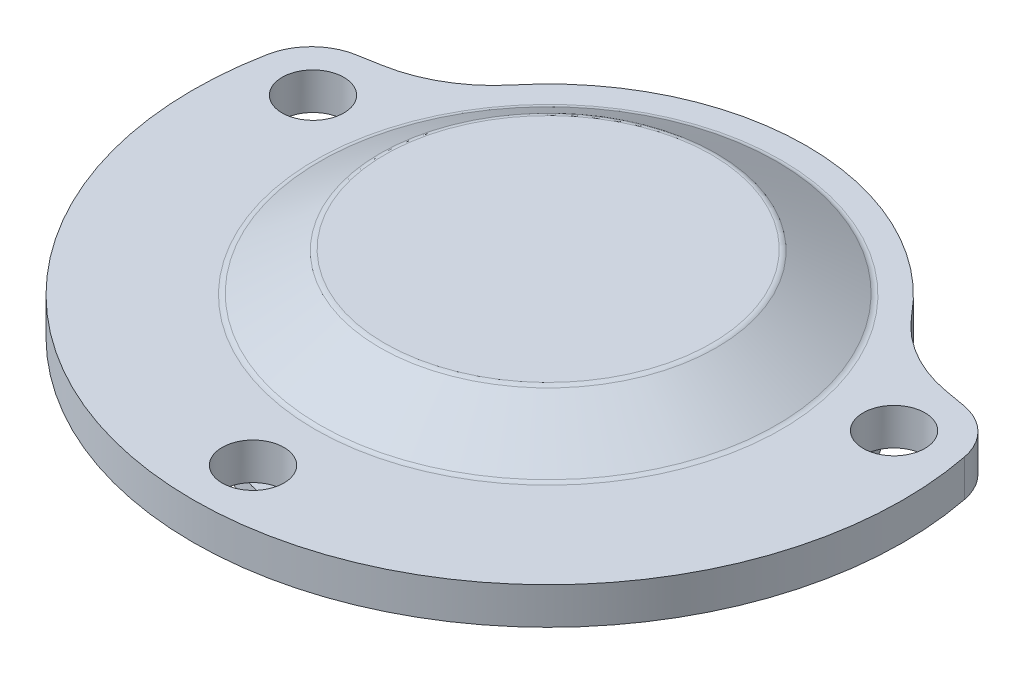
from build123d import *

# Parameters (mm, degrees)
FORO_6_7_6_7_1_D         = 6.7
TAGLIO_ESTRUSIONE2_DEPTH = 10
RACCORDO1_R              = 6
RACCORDO2_R              = 15
RACCORDO3_R              = 1
RACCORDO4_R              = 1


with BuildPart() as part:
    # Schizzo1 → Rivoluzione1 (revolve)
    with BuildSketch(Plane.XY, mode=Mode.PRIVATE) as rivoluzione1_sk:
        Polygon((0, 5), (0, 9.8), (18, 9.8), (25, 5.5), (38.5, 5.5), (38.5, 1.5), (26, 1.5), (26, -0.2), (23.9, -0.2), (23.9, -3.5), (26, -3.5), (26, -5.5), (19, -5.5), (19, 5), align=None)
    revolve(rivoluzione1_sk.sketch.rotate(Axis((0, 0, 0), (0, 1, 0)), 90), axis=Axis((0, 0, 0), (0, 1, 0)))

    # Foro _6.7 _6.7_-1 (through all)
    with Locations(Plane(origin=(0, 5.5, 0), x_dir=(1, 0, 0), z_dir=(0, 1, 0))):
        with Locations((0, -32), (-31.5, 6), (31.5, 6)):
            Hole(FORO_6_7_6_7_1_D / 2)

    # Schizzo5 → Taglio-Estrusione2 (cut)
    with BuildSketch(Plane(origin=(0, 0, 0), x_dir=(1, 0, 0), z_dir=(0, 1, 0))):
        with BuildLine():
            Line((-45, 10), (-24.463539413, 13.62113209))
            ThreePointArc((-24.463539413, 13.62113209), (0, 28), (24.463539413, 13.62113209))
            Line((24.463539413, 13.62113209), (45, 10))
            Line((45, 10), (45, 45))
            Line((45, 45), (-45, 45))
            Line((-45, 45), (-45, 10))
        make_face()
    extrude(amount=TAGLIO_ESTRUSIONE2_DEPTH, mode=Mode.SUBTRACT)

    # Raccordo1
    raccordo1_edges = [part.edges().sort_by_distance(p)[0] for p in [
        (36.756872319, 3.5, -11.453485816),
        (-36.756872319, 3.5, -11.453485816),
    ]]
    fillet(raccordo1_edges, radius=RACCORDO1_R)

    # Raccordo2
    raccordo2_edges = [part.edges().sort_by_distance(p)[0] for p in [
        (-24.463539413, 3.5, -13.62113209),
        (24.463539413, 3.5, -13.62113209),
    ]]
    fillet(raccordo2_edges, radius=RACCORDO2_R)

    # Raccordo3
    raccordo3_edges = [part.edges().sort_by_distance(p)[0] for p in [
        (0, 5.5, 25),
        (0, 9.8, 18),
    ]]
    fillet(raccordo3_edges, radius=RACCORDO3_R)

    # Raccordo4
    raccordo4_edges = [part.edges().sort_by_distance(p)[0] for p in [
        (0, 5, 19),
    ]]
    fillet(raccordo4_edges, radius=RACCORDO4_R)


solid = part.part
